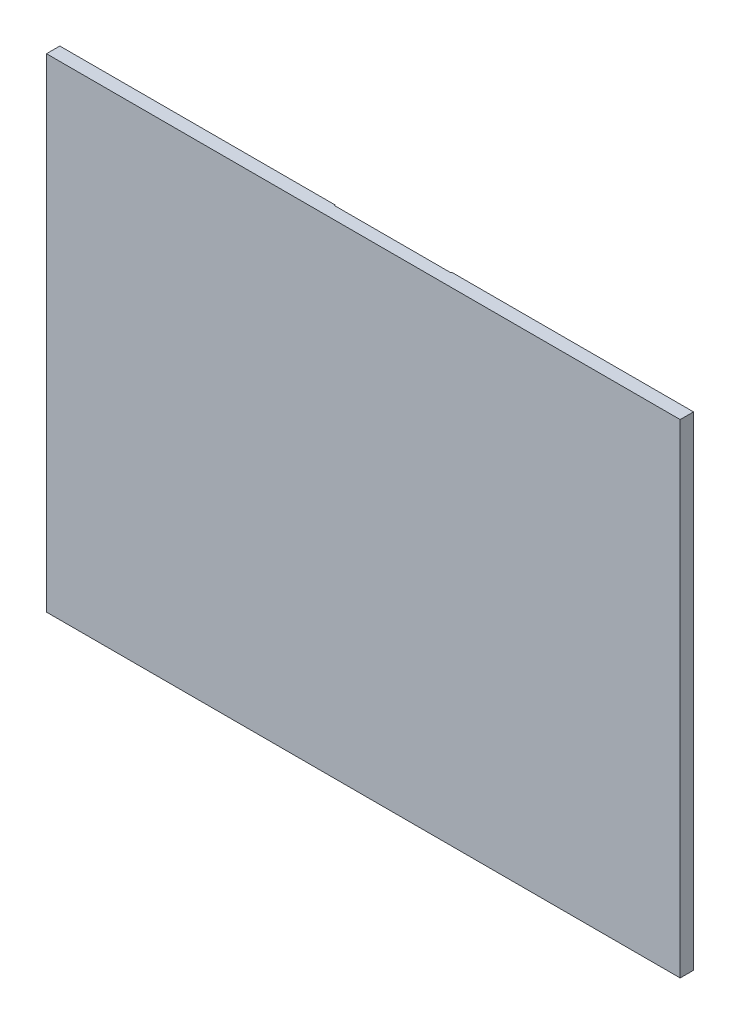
from build123d import *

# Parameters (mm, degrees)
ESQUISSE1_W             = 76
ESQUISSE1_H             = 58
EXTRUSION1_DEPTH        = 1.6
ESQUISSE2_W             = 14
ESQUISSE2_H             = 63.660749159
ENL_V_MAT_EXTRU_1_DEPTH = 0.1


with BuildPart() as part:
    # Esquisse1 → Extrusion1 (new body)
    with BuildSketch(Plane.XY):
        with Locations((19.5, 0)):
            Rectangle(ESQUISSE1_W, ESQUISSE1_H)
    extrude(amount=EXTRUSION1_DEPTH)

    # Esquisse2 → Enl_v. mat.-Extru.1 (cut)
    with BuildSketch(Plane(origin=(0, 0, 0), x_dir=(-1, 0, 0), z_dir=(0, 0, -1))):
        with Locations((-21.5, -0.143811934)):
            Rectangle(ESQUISSE2_W, ESQUISSE2_H)
    extrude(amount=-ENL_V_MAT_EXTRU_1_DEPTH, mode=Mode.SUBTRACT)


solid = part.part
